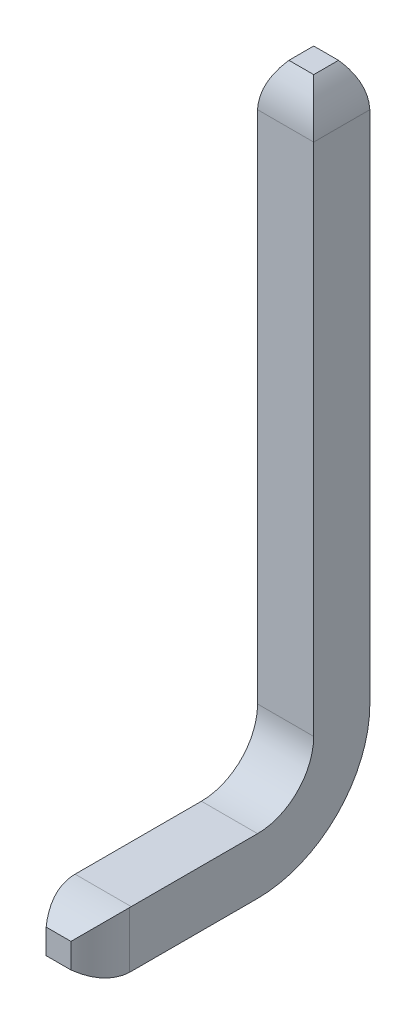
ISO-10303-21;
HEADER;
FILE_DESCRIPTION(('STEP AP214'),'2;1');
FILE_NAME('part.step','',(''),(''),'','','');
FILE_SCHEMA(('AUTOMOTIVE_DESIGN { 1 0 10303 214 1 1 1 1 }'));
ENDSEC;
DATA;
#1=APPLICATION_CONTEXT('core data for automotive mechanical design processes');
#2=APPLICATION_PROTOCOL_DEFINITION('international standard','automotive_design',2000,#1);
#3=PRODUCT_CONTEXT('',#1,'mechanical');
#4=PRODUCT('Part','Part','',(#3));
#5=PRODUCT_RELATED_PRODUCT_CATEGORY('part','',(#4));
#6=PRODUCT_DEFINITION_FORMATION('','',#4);
#7=PRODUCT_DEFINITION_CONTEXT('part definition',#1,'design');
#8=PRODUCT_DEFINITION('design','',#6,#7);
#9=PRODUCT_DEFINITION_SHAPE('','',#8);
#10=(LENGTH_UNIT() NAMED_UNIT(*) SI_UNIT(.MILLI.,.METRE.));
#11=(NAMED_UNIT(*) PLANE_ANGLE_UNIT() SI_UNIT($,.RADIAN.));
#12=(NAMED_UNIT(*) SI_UNIT($,.STERADIAN.) SOLID_ANGLE_UNIT());
#13=UNCERTAINTY_MEASURE_WITH_UNIT(LENGTH_MEASURE(1.E-05),#10,'distance_accuracy_value','');
#14=(GEOMETRIC_REPRESENTATION_CONTEXT(3) GLOBAL_UNCERTAINTY_ASSIGNED_CONTEXT((#13)) GLOBAL_UNIT_ASSIGNED_CONTEXT((#10,
#11,#12)) REPRESENTATION_CONTEXT('',''));
#15=CARTESIAN_POINT('',(0.,0.,0.));
#16=DIRECTION('',(0.,0.,1.));
#17=DIRECTION('',(1.,0.,0.));
#18=AXIS2_PLACEMENT_3D('',#15,#16,#17);
#19=CARTESIAN_POINT('',(0.25019,0.144742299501,2.274099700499));
#20=DIRECTION('',(0.,0.,1.));
#21=DIRECTION('',(0.,-1.,0.));
#22=AXIS2_PLACEMENT_3D('',#19,#20,#21);
#23=PLANE('',#22);
#24=DIRECTION('',(1.,0.,0.));
#25=VECTOR('',#24,1.);
#26=CARTESIAN_POINT('',(-0.25019,0.0050422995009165,2.27409970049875));
#27=LINE('',#26,#25);
#28=CARTESIAN_POINT('',(-0.110489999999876,0.00504229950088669,2.27409970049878));
#29=VERTEX_POINT('',#28);
#30=CARTESIAN_POINT('',(0.110489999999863,0.00504229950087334,2.2740997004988));
#31=VERTEX_POINT('',#30);
#32=EDGE_CURVE('E133',#29,#31,#27,.T.);
#33=ORIENTED_EDGE('',*,*,#32,.F.);
#34=DIRECTION('',(0.,-1.,0.));
#35=VECTOR('',#34,1.);
#36=CARTESIAN_POINT('',(-0.11048999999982,0.144742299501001,2.27409970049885));
#37=LINE('',#36,#35);
#38=CARTESIAN_POINT('',(-0.110489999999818,-0.215937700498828,2.27409970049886));
#39=VERTEX_POINT('',#38);
#40=EDGE_CURVE('E130',#39,#29,#37,.F.);
#41=ORIENTED_EDGE('',*,*,#40,.F.);
#42=DIRECTION('',(1.,0.,0.));
#43=VECTOR('',#42,1.);
#44=CARTESIAN_POINT('',(-0.25019,-0.215937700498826,2.27409970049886));
#45=LINE('',#44,#43);
#46=CARTESIAN_POINT('',(0.110489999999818,-0.215937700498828,2.27409970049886));
#47=VERTEX_POINT('',#46);
#48=EDGE_CURVE('E119',#47,#39,#45,.F.);
#49=ORIENTED_EDGE('',*,*,#48,.F.);
#50=DIRECTION('',(0.,-1.,0.));
#51=VECTOR('',#50,1.);
#52=CARTESIAN_POINT('',(0.110489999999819,0.144742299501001,2.27409970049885));
#53=LINE('',#52,#51);
#54=EDGE_CURVE('E141',#31,#47,#53,.T.);
#55=ORIENTED_EDGE('',*,*,#54,.F.);
#56=EDGE_LOOP('',(#33,#41,#49,#55));
#57=FACE_BOUND('',#56,.T.);
#58=ADVANCED_FACE('F17',(#57),#23,.T.);
#59=CARTESIAN_POINT('',(0.384591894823,0.144742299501,1.87645800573));
#60=DIRECTION('',(0.,-1.,0.));
#61=DIRECTION('',(0.,0.,-1.));
#62=AXIS2_PLACEMENT_3D('',#59,#60,#61);
#63=CYLINDRICAL_SURFACE('',#62,0.635);
#64=CARTESIAN_POINT('',(-0.250190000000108,0.144531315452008,1.893099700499));
#65=CARTESIAN_POINT('',(-0.24981277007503,0.144160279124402,1.90756412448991));
#66=CARTESIAN_POINT('',(-0.248937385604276,0.143291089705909,1.92199284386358));
#67=CARTESIAN_POINT('',(-0.246222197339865,0.140588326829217,1.95065552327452));
#68=CARTESIAN_POINT('',(-0.244383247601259,0.138755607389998,1.96488964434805));
#69=CARTESIAN_POINT('',(-0.237513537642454,0.131904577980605,2.00686603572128));
#70=CARTESIAN_POINT('',(-0.231120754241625,0.125524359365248,2.03418199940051));
#71=CARTESIAN_POINT('',(-0.215201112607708,0.109630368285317,2.0867638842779));
#72=CARTESIAN_POINT('',(-0.205684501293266,0.100126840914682,2.11203617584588));
#73=CARTESIAN_POINT('',(-0.184043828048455,0.0785133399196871,2.16032445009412));
#74=CARTESIAN_POINT('',(-0.171912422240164,0.066396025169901,2.1833338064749));
#75=CARTESIAN_POINT('',(-0.15129887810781,0.045805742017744,2.2174193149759));
#76=CARTESIAN_POINT('',(-0.143507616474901,0.0380231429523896,2.22935261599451));
#77=CARTESIAN_POINT('',(-0.127388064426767,0.0219214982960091,2.25235328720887));
#78=CARTESIAN_POINT('',(-0.119062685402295,0.0136053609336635,2.26342472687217));
#79=CARTESIAN_POINT('',(-0.11048999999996,0.00504229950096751,2.27409970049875));
#80=B_SPLINE_CURVE_WITH_KNOTS('',3,(#64,#65,#66,#67,#68,#69,#70,#71,#72,#73,#74,#75,#76,#77,#78,
#79),.UNSPECIFIED.,.F.,.F.,(4,2,2,2,2,2,2,4),(0.,0.0433870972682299,0.0867358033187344,
0.172547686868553,0.258080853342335,0.343857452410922,0.392536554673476,0.440969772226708),.UNSPECIFIED.);
#81=CARTESIAN_POINT('',(-0.250190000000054,0.144531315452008,1.893099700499));
#82=VERTEX_POINT('',#81);
#83=EDGE_CURVE('E152',#82,#29,#80,.T.);
#84=ORIENTED_EDGE('',*,*,#83,.F.);
#85=DIRECTION('',(0.,1.,0.));
#86=VECTOR('',#85,1.);
#87=CARTESIAN_POINT('',(-0.250189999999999,0.144742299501,1.893099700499));
#88=LINE('',#87,#86);
#89=CARTESIAN_POINT('',(-0.250190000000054,-0.355426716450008,1.893099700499));
#90=VERTEX_POINT('',#89);
#91=EDGE_CURVE('E140',#82,#90,#88,.F.);
#92=ORIENTED_EDGE('',*,*,#91,.T.);
#93=CARTESIAN_POINT('',(-0.110489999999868,-0.215937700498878,2.2740997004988));
#94=CARTESIAN_POINT('',(-0.127635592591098,-0.233064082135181,2.25276889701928));
#95=CARTESIAN_POINT('',(-0.143837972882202,-0.249248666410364,2.22975119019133));
#96=CARTESIAN_POINT('',(-0.173789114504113,-0.279165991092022,2.18023573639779));
#97=CARTESIAN_POINT('',(-0.187504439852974,-0.292865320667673,2.15369784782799));
#98=CARTESIAN_POINT('',(-0.211535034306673,-0.316864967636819,2.09736919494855));
#99=CARTESIAN_POINT('',(-0.221823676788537,-0.327138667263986,2.06755524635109));
#100=CARTESIAN_POINT('',(-0.237911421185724,-0.34319724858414,2.0057644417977));
#101=CARTESIAN_POINT('',(-0.243743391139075,-0.349014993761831,1.97380534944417));
#102=CARTESIAN_POINT('',(-0.247902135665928,-0.353156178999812,1.93339767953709));
#103=CARTESIAN_POINT('',(-0.248573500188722,-0.353824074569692,1.9253676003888));
#104=CARTESIAN_POINT('',(-0.249611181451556,-0.354854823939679,1.9092622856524));
#105=CARTESIAN_POINT('',(-0.24997727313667,-0.355217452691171,1.90118702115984));
#106=CARTESIAN_POINT('',(-0.250190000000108,-0.355426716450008,1.893099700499));
#107=B_SPLINE_CURVE_WITH_KNOTS('',3,(#93,#94,#95,#96,#97,#98,#99,#100,#101,#102,#103,#104,#105,
#106),.UNSPECIFIED.,.F.,.F.,(4,2,2,2,2,2,4),(0.,0.0969606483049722,0.195141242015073,
0.294067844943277,0.392257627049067,0.416507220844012,0.440774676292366),.UNSPECIFIED.);
#108=EDGE_CURVE('E20',#39,#90,#107,.T.);
#109=ORIENTED_EDGE('',*,*,#108,.F.);
#110=ORIENTED_EDGE('',*,*,#40,.T.);
#111=EDGE_LOOP('',(#84,#92,#109,#110));
#112=FACE_BOUND('',#111,.T.);
#113=ADVANCED_FACE('F138',(#112),#63,.T.);
#114=CARTESIAN_POINT('',(-0.25019,0.279362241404,1.876729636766));
#115=DIRECTION('',(1.,0.,0.));
#116=DIRECTION('',(0.,0.,-1.));
#117=AXIS2_PLACEMENT_3D('',#114,#115,#116);
#118=CYLINDRICAL_SURFACE('',#117,0.635);
#119=CARTESIAN_POINT('',(-0.25019,0.279362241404,1.876729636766));
#120=DIRECTION('',(1.,0.,0.));
#121=DIRECTION('',(0.,0.,-1.));
#122=AXIS2_PLACEMENT_3D('',#119,#120,#121);
#123=CIRCLE('',#122,0.635);
#124=CARTESIAN_POINT('',(-0.25019,-0.355637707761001,1.876729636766));
#125=VERTEX_POINT('',#124);
#126=EDGE_CURVE('E235',#90,#125,#123,.T.);
#127=ORIENTED_EDGE('',*,*,#126,.T.);
#128=DIRECTION('',(1.,0.,0.));
#129=VECTOR('',#128,1.);
#130=CARTESIAN_POINT('',(-0.25019,-0.355637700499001,1.876729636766));
#131=LINE('',#130,#129);
#132=CARTESIAN_POINT('',(0.250190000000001,-0.355637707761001,1.876729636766));
#133=VERTEX_POINT('',#132);
#134=EDGE_CURVE('E145',#133,#125,#131,.F.);
#135=ORIENTED_EDGE('',*,*,#134,.F.);
#136=CARTESIAN_POINT('',(0.250190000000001,0.279362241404,1.876729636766));
#137=DIRECTION('',(1.,0.,0.));
#138=DIRECTION('',(0.,0.,-1.));
#139=AXIS2_PLACEMENT_3D('',#136,#137,#138);
#140=CIRCLE('',#139,0.635);
#141=CARTESIAN_POINT('',(0.250190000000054,-0.355426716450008,1.893099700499));
#142=VERTEX_POINT('',#141);
#143=EDGE_CURVE('E238',#142,#133,#140,.T.);
#144=ORIENTED_EDGE('',*,*,#143,.F.);
#145=CARTESIAN_POINT('',(0.110489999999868,-0.215937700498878,2.2740997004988));
#146=CARTESIAN_POINT('',(0.127635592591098,-0.233064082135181,2.25276889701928));
#147=CARTESIAN_POINT('',(0.143837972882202,-0.249248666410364,2.22975119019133));
#148=CARTESIAN_POINT('',(0.173789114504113,-0.279165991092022,2.18023573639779));
#149=CARTESIAN_POINT('',(0.187504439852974,-0.292865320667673,2.15369784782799));
#150=CARTESIAN_POINT('',(0.211535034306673,-0.316864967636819,2.09736919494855));
#151=CARTESIAN_POINT('',(0.221823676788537,-0.327138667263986,2.06755524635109));
#152=CARTESIAN_POINT('',(0.237911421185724,-0.34319724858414,2.0057644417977));
#153=CARTESIAN_POINT('',(0.243743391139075,-0.349014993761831,1.97380534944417));
#154=CARTESIAN_POINT('',(0.247902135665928,-0.353156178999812,1.93339767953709));
#155=CARTESIAN_POINT('',(0.248573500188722,-0.353824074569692,1.9253676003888));
#156=CARTESIAN_POINT('',(0.249611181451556,-0.354854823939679,1.9092622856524));
#157=CARTESIAN_POINT('',(0.24997727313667,-0.355217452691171,1.90118702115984));
#158=CARTESIAN_POINT('',(0.250190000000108,-0.355426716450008,1.893099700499));
#159=B_SPLINE_CURVE_WITH_KNOTS('',3,(#145,#146,#147,#148,#149,#150,#151,#152,#153,#154,#155,
#156,#157,#158),.UNSPECIFIED.,.F.,.F.,(4,2,2,2,2,2,4),(0.,0.0969606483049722,0.195141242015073,
0.294067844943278,0.392257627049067,0.416507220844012,0.440774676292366),.UNSPECIFIED.);
#160=EDGE_CURVE('E126',#47,#142,#159,.T.);
#161=ORIENTED_EDGE('',*,*,#160,.F.);
#162=ORIENTED_EDGE('',*,*,#48,.T.);
#163=ORIENTED_EDGE('',*,*,#108,.T.);
#164=EDGE_LOOP('',(#127,#135,#144,#161,#162,#163));
#165=FACE_BOUND('',#164,.T.);
#166=ADVANCED_FACE('F122',(#165),#118,.T.);
#167=CARTESIAN_POINT('',(-0.384591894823,0.144742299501,1.87645800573));
#168=DIRECTION('',(0.,-1.,0.));
#169=DIRECTION('',(0.,0.,-1.));
#170=AXIS2_PLACEMENT_3D('',#167,#168,#169);
#171=CYLINDRICAL_SURFACE('',#170,0.635);
#172=CARTESIAN_POINT('',(0.110489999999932,0.00504229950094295,2.27409970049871));
#173=CARTESIAN_POINT('',(0.127635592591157,0.0221686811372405,2.25276889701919));
#174=CARTESIAN_POINT('',(0.143837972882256,0.038353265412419,2.22975119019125));
#175=CARTESIAN_POINT('',(0.173789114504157,0.0682705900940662,2.18023573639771));
#176=CARTESIAN_POINT('',(0.187504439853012,0.0819699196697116,2.15369784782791));
#177=CARTESIAN_POINT('',(0.211535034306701,0.105969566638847,2.09736919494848));
#178=CARTESIAN_POINT('',(0.22182367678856,0.116243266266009,2.06755524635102));
#179=CARTESIAN_POINT('',(0.237911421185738,0.132301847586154,2.00576444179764));
#180=CARTESIAN_POINT('',(0.243743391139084,0.138119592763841,1.97380534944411));
#181=CARTESIAN_POINT('',(0.247902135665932,0.142260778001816,1.93339767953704));
#182=CARTESIAN_POINT('',(0.248573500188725,0.142928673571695,1.92536760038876));
#183=CARTESIAN_POINT('',(0.249611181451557,0.14395942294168,1.90926228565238));
#184=CARTESIAN_POINT('',(0.24997727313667,0.144322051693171,1.90118702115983));
#185=CARTESIAN_POINT('',(0.250190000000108,0.144531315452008,1.893099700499));
#186=B_SPLINE_CURVE_WITH_KNOTS('',3,(#172,#173,#174,#175,#176,#177,#178,#179,#180,#181,#182,
#183,#184,#185),.UNSPECIFIED.,.F.,.F.,(4,2,2,2,2,2,4),(0.,0.0969606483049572,0.195141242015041,
0.29406784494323,0.392257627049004,0.41650722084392,0.440774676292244),.UNSPECIFIED.);
#187=CARTESIAN_POINT('',(0.250190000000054,0.144531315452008,1.893099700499));
#188=VERTEX_POINT('',#187);
#189=EDGE_CURVE('E227',#31,#188,#186,.T.);
#190=ORIENTED_EDGE('',*,*,#189,.F.);
#191=ORIENTED_EDGE('',*,*,#54,.T.);
#192=ORIENTED_EDGE('',*,*,#160,.T.);
#193=DIRECTION('',(0.,1.,0.));
#194=VECTOR('',#193,1.);
#195=CARTESIAN_POINT('',(0.250190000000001,0.144742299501,1.893099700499));
#196=LINE('',#195,#194);
#197=EDGE_CURVE('E244',#188,#142,#196,.F.);
#198=ORIENTED_EDGE('',*,*,#197,.F.);
#199=EDGE_LOOP('',(#190,#191,#192,#198));
#200=FACE_BOUND('',#199,.T.);
#201=ADVANCED_FACE('F158',(#200),#171,.T.);
#202=CARTESIAN_POINT('',(-0.25019,-0.355637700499,2.274099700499));
#203=DIRECTION('',(0.,-1.,0.));
#204=DIRECTION('',(0.,0.,-1.));
#205=AXIS2_PLACEMENT_3D('',#202,#203,#204);
#206=PLANE('',#205);
#207=DIRECTION('',(0.,0.,-1.));
#208=VECTOR('',#207,1.);
#209=CARTESIAN_POINT('',(-0.25019,-0.355637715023,-5.396700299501));
#210=LINE('',#209,#208);
#211=CARTESIAN_POINT('',(-0.25019,-0.355637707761,0.75057));
#212=VERTEX_POINT('',#211);
#213=EDGE_CURVE('E237',#125,#212,#210,.T.);
#214=ORIENTED_EDGE('',*,*,#213,.T.);
#215=DIRECTION('',(1.,0.,0.));
#216=VECTOR('',#215,1.);
#217=CARTESIAN_POINT('',(-7.953561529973,-0.355637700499,0.75057));
#218=LINE('',#217,#216);
#219=CARTESIAN_POINT('',(0.250190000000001,-0.355637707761,0.75057));
#220=VERTEX_POINT('',#219);
#221=EDGE_CURVE('E284',#220,#212,#218,.F.);
#222=ORIENTED_EDGE('',*,*,#221,.F.);
#223=DIRECTION('',(0.,0.,-1.));
#224=VECTOR('',#223,1.);
#225=CARTESIAN_POINT('',(0.25019,-0.355637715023,-5.396700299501));
#226=LINE('',#225,#224);
#227=EDGE_CURVE('E240',#133,#220,#226,.T.);
#228=ORIENTED_EDGE('',*,*,#227,.F.);
#229=ORIENTED_EDGE('',*,*,#134,.T.);
#230=EDGE_LOOP('',(#214,#222,#228,#229));
#231=FACE_BOUND('',#230,.T.);
#232=ADVANCED_FACE('F224',(#231),#206,.T.);
#233=CARTESIAN_POINT('',(-0.25019,-0.490257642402,1.876729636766));
#234=DIRECTION('',(1.,0.,0.));
#235=DIRECTION('',(0.,0.,-1.));
#236=AXIS2_PLACEMENT_3D('',#233,#234,#235);
#237=CYLINDRICAL_SURFACE('',#236,0.635);
#238=ORIENTED_EDGE('',*,*,#189,.T.);
#239=CARTESIAN_POINT('',(0.250190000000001,-0.490257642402,1.876729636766));
#240=DIRECTION('',(1.,0.,0.));
#241=DIRECTION('',(0.,0.,-1.));
#242=AXIS2_PLACEMENT_3D('',#239,#240,#241);
#243=CIRCLE('',#242,0.635);
#244=CARTESIAN_POINT('',(0.25019,0.144742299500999,1.876729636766));
#245=VERTEX_POINT('',#244);
#246=EDGE_CURVE('E241',#245,#188,#243,.T.);
#247=ORIENTED_EDGE('',*,*,#246,.F.);
#248=DIRECTION('',(1.,0.,0.));
#249=VECTOR('',#248,1.);
#250=CARTESIAN_POINT('',(-0.25019,0.144742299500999,1.876729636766));
#251=LINE('',#250,#249);
#252=CARTESIAN_POINT('',(-0.25019,0.144742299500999,1.876729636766));
#253=VERTEX_POINT('',#252);
#254=EDGE_CURVE('E277',#245,#253,#251,.F.);
#255=ORIENTED_EDGE('',*,*,#254,.T.);
#256=CARTESIAN_POINT('',(-0.25019,-0.490257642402,1.876729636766));
#257=DIRECTION('',(1.,0.,0.));
#258=DIRECTION('',(0.,0.,-1.));
#259=AXIS2_PLACEMENT_3D('',#256,#257,#258);
#260=CIRCLE('',#259,0.635);
#261=EDGE_CURVE('E232',#253,#82,#260,.T.);
#262=ORIENTED_EDGE('',*,*,#261,.T.);
#263=ORIENTED_EDGE('',*,*,#83,.T.);
#264=ORIENTED_EDGE('',*,*,#32,.T.);
#265=EDGE_LOOP('',(#238,#247,#255,#262,#263,#264));
#266=FACE_BOUND('',#265,.T.);
#267=ADVANCED_FACE('F220',(#266),#237,.T.);
#268=CARTESIAN_POINT('',(-7.953561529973,0.645122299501,0.75057));
#269=DIRECTION('',(1.,0.,0.));
#270=DIRECTION('',(0.,0.,-1.));
#271=AXIS2_PLACEMENT_3D('',#268,#269,#270);
#272=CYLINDRICAL_SURFACE('',#271,1.00076);
#273=ORIENTED_EDGE('',*,*,#221,.T.);
#274=CARTESIAN_POINT('',(-0.25019,0.645122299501,0.75057));
#275=DIRECTION('',(1.,0.,0.));
#276=DIRECTION('',(0.,0.,-1.));
#277=AXIS2_PLACEMENT_3D('',#274,#275,#276);
#278=CIRCLE('',#277,1.00076);
#279=CARTESIAN_POINT('',(-0.25019,0.645122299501,-0.25019));
#280=VERTEX_POINT('',#279);
#281=EDGE_CURVE('E245',#212,#280,#278,.T.);
#282=ORIENTED_EDGE('',*,*,#281,.T.);
#283=DIRECTION('',(1.,0.,0.));
#284=VECTOR('',#283,1.);
#285=CARTESIAN_POINT('',(-7.953561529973,0.645122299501,-0.25019));
#286=LINE('',#285,#284);
#287=CARTESIAN_POINT('',(0.250190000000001,0.645122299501,-0.25019));
#288=VERTEX_POINT('',#287);
#289=EDGE_CURVE('E274',#280,#288,#286,.T.);
#290=ORIENTED_EDGE('',*,*,#289,.T.);
#291=CARTESIAN_POINT('',(0.250190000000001,0.645122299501,0.75057));
#292=DIRECTION('',(1.,0.,0.));
#293=DIRECTION('',(0.,0.,-1.));
#294=AXIS2_PLACEMENT_3D('',#291,#292,#293);
#295=CIRCLE('',#294,1.00076);
#296=EDGE_CURVE('E248',#220,#288,#295,.T.);
#297=ORIENTED_EDGE('',*,*,#296,.F.);
#298=EDGE_LOOP('',(#273,#282,#290,#297));
#299=FACE_BOUND('',#298,.T.);
#300=ADVANCED_FACE('F217',(#299),#272,.T.);
#301=CARTESIAN_POINT('',(-0.25019,0.144742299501,2.274099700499));
#302=DIRECTION('',(0.,-1.,0.));
#303=DIRECTION('',(0.,0.,-1.));
#304=AXIS2_PLACEMENT_3D('',#301,#302,#303);
#305=PLANE('',#304);
#306=ORIENTED_EDGE('',*,*,#254,.F.);
#307=DIRECTION('',(0.,0.,-1.));
#308=VECTOR('',#307,1.);
#309=CARTESIAN_POINT('',(0.25019,0.144742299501,2.274099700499));
#310=LINE('',#309,#308);
#311=CARTESIAN_POINT('',(0.250190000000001,0.144742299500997,0.750570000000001));
#312=VERTEX_POINT('',#311);
#313=EDGE_CURVE('E280',#312,#245,#310,.F.);
#314=ORIENTED_EDGE('',*,*,#313,.F.);
#315=DIRECTION('',(1.,0.,0.));
#316=VECTOR('',#315,1.);
#317=CARTESIAN_POINT('',(-7.953561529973,0.144742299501,0.75057));
#318=LINE('',#317,#316);
#319=CARTESIAN_POINT('',(-0.25019,0.144742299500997,0.750570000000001));
#320=VERTEX_POINT('',#319);
#321=EDGE_CURVE('E259',#312,#320,#318,.F.);
#322=ORIENTED_EDGE('',*,*,#321,.T.);
#323=DIRECTION('',(0.,0.,-1.));
#324=VECTOR('',#323,1.);
#325=CARTESIAN_POINT('',(-0.25019,0.144742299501,2.274099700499));
#326=LINE('',#325,#324);
#327=EDGE_CURVE('E249',#253,#320,#326,.T.);
#328=ORIENTED_EDGE('',*,*,#327,.F.);
#329=EDGE_LOOP('',(#306,#314,#322,#328));
#330=FACE_BOUND('',#329,.T.);
#331=ADVANCED_FACE('F213',(#330),#305,.F.);
#332=CARTESIAN_POINT('',(-0.384591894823,5.215758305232,-0.25019));
#333=DIRECTION('',(0.,0.,1.));
#334=DIRECTION('',(1.,0.,0.));
#335=AXIS2_PLACEMENT_3D('',#332,#333,#334);
#336=CYLINDRICAL_SURFACE('',#335,0.635);
#337=DIRECTION('',(0.,0.,1.));
#338=VECTOR('',#337,1.);
#339=CARTESIAN_POINT('',(0.11049,5.6134,0.25019));
#340=LINE('',#339,#338);
#341=CARTESIAN_POINT('',(0.110490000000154,5.61340000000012,0.110490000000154));
#342=VERTEX_POINT('',#341);
#343=CARTESIAN_POINT('',(0.110490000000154,5.61340000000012,-0.110490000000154));
#344=VERTEX_POINT('',#343);
#345=EDGE_CURVE('E252',#342,#344,#340,.F.);
#346=ORIENTED_EDGE('',*,*,#345,.F.);
#347=CARTESIAN_POINT('',(-0.384591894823,5.215758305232,-0.384591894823));
#348=DIRECTION('',(0.707106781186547,0.,-0.707106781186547));
#349=DIRECTION('',(0.707106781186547,0.,0.707106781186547));
#350=AXIS2_PLACEMENT_3D('',#347,#348,#349);
#351=ELLIPSE('',#350,0.898025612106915,0.635);
#352=CARTESIAN_POINT('',(0.25019,5.23240000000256,0.25019));
#353=VERTEX_POINT('',#352);
#354=EDGE_CURVE('E262',#353,#342,#351,.F.);
#355=ORIENTED_EDGE('',*,*,#354,.F.);
#356=DIRECTION('',(0.,0.,1.));
#357=VECTOR('',#356,1.);
#358=CARTESIAN_POINT('',(0.25019,5.2324,0.25019));
#359=LINE('',#358,#357);
#360=CARTESIAN_POINT('',(0.25019,5.23240000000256,-0.25019));
#361=VERTEX_POINT('',#360);
#362=EDGE_CURVE('E301',#361,#353,#359,.T.);
#363=ORIENTED_EDGE('',*,*,#362,.F.);
#364=CARTESIAN_POINT('',(-0.384591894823,5.215758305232,0.384591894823));
#365=DIRECTION('',(0.707106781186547,0.,0.707106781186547));
#366=DIRECTION('',(0.707106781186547,0.,-0.707106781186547));
#367=AXIS2_PLACEMENT_3D('',#364,#365,#366);
#368=ELLIPSE('',#367,0.898025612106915,0.635);
#369=EDGE_CURVE('E253',#344,#361,#368,.F.);
#370=ORIENTED_EDGE('',*,*,#369,.F.);
#371=EDGE_LOOP('',(#346,#355,#363,#370));
#372=FACE_BOUND('',#371,.T.);
#373=ADVANCED_FACE('F209',(#372),#336,.T.);
#374=CARTESIAN_POINT('',(-0.25019,5.6134,0.25019));
#375=DIRECTION('',(0.,1.,0.));
#376=DIRECTION('',(0.,0.,1.));
#377=AXIS2_PLACEMENT_3D('',#374,#375,#376);
#378=PLANE('',#377);
#379=DIRECTION('',(1.,0.,0.));
#380=VECTOR('',#379,1.);
#381=CARTESIAN_POINT('',(-0.25019,5.61340000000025,0.110490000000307));
#382=LINE('',#381,#380);
#383=CARTESIAN_POINT('',(-0.110490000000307,5.61340000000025,0.110490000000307));
#384=VERTEX_POINT('',#383);
#385=EDGE_CURVE('E264',#342,#384,#382,.F.);
#386=ORIENTED_EDGE('',*,*,#385,.F.);
#387=ORIENTED_EDGE('',*,*,#345,.T.);
#388=DIRECTION('',(1.,0.,0.));
#389=VECTOR('',#388,1.);
#390=CARTESIAN_POINT('',(-0.25019,5.61340000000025,-0.110490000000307));
#391=LINE('',#390,#389);
#392=CARTESIAN_POINT('',(-0.110490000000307,5.61340000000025,-0.110490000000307));
#393=VERTEX_POINT('',#392);
#394=EDGE_CURVE('E256',#393,#344,#391,.T.);
#395=ORIENTED_EDGE('',*,*,#394,.F.);
#396=DIRECTION('',(0.,0.,1.));
#397=VECTOR('',#396,1.);
#398=CARTESIAN_POINT('',(-0.110490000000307,5.61340000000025,-0.25019));
#399=LINE('',#398,#397);
#400=EDGE_CURVE('E268',#384,#393,#399,.F.);
#401=ORIENTED_EDGE('',*,*,#400,.F.);
#402=EDGE_LOOP('',(#386,#387,#395,#401));
#403=FACE_BOUND('',#402,.T.);
#404=ADVANCED_FACE('F205',(#403),#378,.T.);
#405=CARTESIAN_POINT('',(-0.25019,5.215758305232,0.384591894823));
#406=DIRECTION('',(1.,0.,0.));
#407=DIRECTION('',(0.,0.,-1.));
#408=AXIS2_PLACEMENT_3D('',#405,#406,#407);
#409=CYLINDRICAL_SURFACE('',#408,0.635);
#410=DIRECTION('',(-1.,0.,0.));
#411=VECTOR('',#410,1.);
#412=CARTESIAN_POINT('',(-0.25019,5.2324,-0.25019));
#413=LINE('',#412,#411);
#414=CARTESIAN_POINT('',(-0.25019,5.23240000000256,-0.25019));
#415=VERTEX_POINT('',#414);
#416=EDGE_CURVE('E298',#415,#361,#413,.F.);
#417=ORIENTED_EDGE('',*,*,#416,.F.);
#418=CARTESIAN_POINT('',(0.384591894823,5.215758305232,0.384591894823));
#419=DIRECTION('',(-0.707106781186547,0.,0.707106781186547));
#420=DIRECTION('',(0.707106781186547,0.,0.707106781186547));
#421=AXIS2_PLACEMENT_3D('',#418,#419,#420);
#422=ELLIPSE('',#421,0.898025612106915,0.635);
#423=EDGE_CURVE('E265',#393,#415,#422,.T.);
#424=ORIENTED_EDGE('',*,*,#423,.F.);
#425=ORIENTED_EDGE('',*,*,#394,.T.);
#426=ORIENTED_EDGE('',*,*,#369,.T.);
#427=EDGE_LOOP('',(#417,#424,#425,#426));
#428=FACE_BOUND('',#427,.T.);
#429=ADVANCED_FACE('F201',(#428),#409,.T.);
#430=CARTESIAN_POINT('',(-7.953561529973,0.645122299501,0.75057));
#431=DIRECTION('',(1.,0.,0.));
#432=DIRECTION('',(0.,0.,-1.));
#433=AXIS2_PLACEMENT_3D('',#430,#431,#432);
#434=CYLINDRICAL_SURFACE('',#433,0.50038);
#435=ORIENTED_EDGE('',*,*,#321,.F.);
#436=CARTESIAN_POINT('',(0.250190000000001,0.645122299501,0.75057));
#437=DIRECTION('',(1.,0.,0.));
#438=DIRECTION('',(0.,0.,-1.));
#439=AXIS2_PLACEMENT_3D('',#436,#437,#438);
#440=CIRCLE('',#439,0.50038);
#441=CARTESIAN_POINT('',(0.25019,0.645122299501,0.25019));
#442=VERTEX_POINT('',#441);
#443=EDGE_CURVE('E255',#442,#312,#440,.F.);
#444=ORIENTED_EDGE('',*,*,#443,.F.);
#445=DIRECTION('',(-1.,0.,0.));
#446=VECTOR('',#445,1.);
#447=CARTESIAN_POINT('',(-0.25019,0.645122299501,0.25019));
#448=LINE('',#447,#446);
#449=CARTESIAN_POINT('',(-0.25019,0.645122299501,0.25019));
#450=VERTEX_POINT('',#449);
#451=EDGE_CURVE('E270',#442,#450,#448,.T.);
#452=ORIENTED_EDGE('',*,*,#451,.T.);
#453=CARTESIAN_POINT('',(-0.25019,0.645122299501,0.75057));
#454=DIRECTION('',(1.,0.,0.));
#455=DIRECTION('',(0.,0.,-1.));
#456=AXIS2_PLACEMENT_3D('',#453,#454,#455);
#457=CIRCLE('',#456,0.50038);
#458=EDGE_CURVE('E260',#320,#450,#457,.T.);
#459=ORIENTED_EDGE('',*,*,#458,.F.);
#460=EDGE_LOOP('',(#435,#444,#452,#459));
#461=FACE_BOUND('',#460,.T.);
#462=ADVANCED_FACE('F197',(#461),#434,.F.);
#463=CARTESIAN_POINT('',(-0.25019,5.215758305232,-0.384591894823));
#464=DIRECTION('',(1.,0.,0.));
#465=DIRECTION('',(0.,0.,-1.));
#466=AXIS2_PLACEMENT_3D('',#463,#464,#465);
#467=CYLINDRICAL_SURFACE('',#466,0.635);
#468=ORIENTED_EDGE('',*,*,#385,.T.);
#469=CARTESIAN_POINT('',(0.384591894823,5.215758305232,-0.384591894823));
#470=DIRECTION('',(0.707106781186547,0.,0.707106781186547));
#471=DIRECTION('',(-0.707106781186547,0.,0.707106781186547));
#472=AXIS2_PLACEMENT_3D('',#469,#470,#471);
#473=ELLIPSE('',#472,0.898025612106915,0.635);
#474=CARTESIAN_POINT('',(-0.25019,5.23240000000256,0.25019));
#475=VERTEX_POINT('',#474);
#476=EDGE_CURVE('E267',#475,#384,#473,.F.);
#477=ORIENTED_EDGE('',*,*,#476,.F.);
#478=DIRECTION('',(-1.,0.,0.));
#479=VECTOR('',#478,1.);
#480=CARTESIAN_POINT('',(-0.25019,5.2324,0.25019));
#481=LINE('',#480,#479);
#482=EDGE_CURVE('E38',#475,#353,#481,.F.);
#483=ORIENTED_EDGE('',*,*,#482,.T.);
#484=ORIENTED_EDGE('',*,*,#354,.T.);
#485=EDGE_LOOP('',(#468,#477,#483,#484));
#486=FACE_BOUND('',#485,.T.);
#487=ADVANCED_FACE('F193',(#486),#467,.T.);
#488=CARTESIAN_POINT('',(0.25019,5.6134,0.25019));
#489=DIRECTION('',(1.,0.,0.));
#490=DIRECTION('',(0.,1.,0.));
#491=AXIS2_PLACEMENT_3D('',#488,#489,#490);
#492=PLANE('',#491);
#493=DIRECTION('',(0.,1.,0.));
#494=VECTOR('',#493,1.);
#495=CARTESIAN_POINT('',(0.25019,-2.0574,0.25019));
#496=LINE('',#495,#494);
#497=EDGE_CURVE('E303',#353,#442,#496,.F.);
#498=ORIENTED_EDGE('',*,*,#497,.T.);
#499=ORIENTED_EDGE('',*,*,#443,.T.);
#500=ORIENTED_EDGE('',*,*,#313,.T.);
#501=ORIENTED_EDGE('',*,*,#246,.T.);
#502=ORIENTED_EDGE('',*,*,#197,.T.);
#503=ORIENTED_EDGE('',*,*,#143,.T.);
#504=ORIENTED_EDGE('',*,*,#227,.T.);
#505=ORIENTED_EDGE('',*,*,#296,.T.);
#506=DIRECTION('',(0.,1.,0.));
#507=VECTOR('',#506,1.);
#508=CARTESIAN_POINT('',(0.25019,-2.0574,-0.25019));
#509=LINE('',#508,#507);
#510=EDGE_CURVE('E295',#361,#288,#509,.F.);
#511=ORIENTED_EDGE('',*,*,#510,.F.);
#512=ORIENTED_EDGE('',*,*,#362,.T.);
#513=EDGE_LOOP('',(#498,#499,#500,#501,#502,#503,#504,#505,#511,#512));
#514=FACE_BOUND('',#513,.T.);
#515=ADVANCED_FACE('F189',(#514),#492,.T.);
#516=CARTESIAN_POINT('',(-0.25019,-2.0574,-0.25019));
#517=DIRECTION('',(0.,0.,-1.));
#518=DIRECTION('',(-1.,0.,0.));
#519=AXIS2_PLACEMENT_3D('',#516,#517,#518);
#520=PLANE('',#519);
#521=ORIENTED_EDGE('',*,*,#289,.F.);
#522=DIRECTION('',(0.,1.,0.));
#523=VECTOR('',#522,1.);
#524=CARTESIAN_POINT('',(-0.25019,5.6134,-0.25019));
#525=LINE('',#524,#523);
#526=EDGE_CURVE('E306',#280,#415,#525,.T.);
#527=ORIENTED_EDGE('',*,*,#526,.T.);
#528=ORIENTED_EDGE('',*,*,#416,.T.);
#529=ORIENTED_EDGE('',*,*,#510,.T.);
#530=EDGE_LOOP('',(#521,#527,#528,#529));
#531=FACE_BOUND('',#530,.T.);
#532=ADVANCED_FACE('F185',(#531),#520,.T.);
#533=CARTESIAN_POINT('',(0.384591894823,5.215758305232,-0.25019));
#534=DIRECTION('',(0.,0.,1.));
#535=DIRECTION('',(1.,0.,0.));
#536=AXIS2_PLACEMENT_3D('',#533,#534,#535);
#537=CYLINDRICAL_SURFACE('',#536,0.635);
#538=DIRECTION('',(0.,0.,1.));
#539=VECTOR('',#538,1.);
#540=CARTESIAN_POINT('',(-0.25019,5.2324,0.25019));
#541=LINE('',#540,#539);
#542=EDGE_CURVE('E30',#415,#475,#541,.T.);
#543=ORIENTED_EDGE('',*,*,#542,.T.);
#544=ORIENTED_EDGE('',*,*,#476,.T.);
#545=ORIENTED_EDGE('',*,*,#400,.T.);
#546=ORIENTED_EDGE('',*,*,#423,.T.);
#547=EDGE_LOOP('',(#543,#544,#545,#546));
#548=FACE_BOUND('',#547,.T.);
#549=ADVANCED_FACE('F179',(#548),#537,.T.);
#550=CARTESIAN_POINT('',(-0.25019,-2.0574,0.25019));
#551=DIRECTION('',(0.,0.,-1.));
#552=DIRECTION('',(-1.,0.,0.));
#553=AXIS2_PLACEMENT_3D('',#550,#551,#552);
#554=PLANE('',#553);
#555=ORIENTED_EDGE('',*,*,#482,.F.);
#556=DIRECTION('',(0.,1.,0.));
#557=VECTOR('',#556,1.);
#558=CARTESIAN_POINT('',(-0.25019,5.6134,0.25019));
#559=LINE('',#558,#557);
#560=EDGE_CURVE('E11',#475,#450,#559,.F.);
#561=ORIENTED_EDGE('',*,*,#560,.T.);
#562=ORIENTED_EDGE('',*,*,#451,.F.);
#563=ORIENTED_EDGE('',*,*,#497,.F.);
#564=EDGE_LOOP('',(#555,#561,#562,#563));
#565=FACE_BOUND('',#564,.T.);
#566=ADVANCED_FACE('F173',(#565),#554,.F.);
#567=CARTESIAN_POINT('',(-0.25019,5.6134,0.25019));
#568=DIRECTION('',(1.,0.,0.));
#569=DIRECTION('',(0.,1.,0.));
#570=AXIS2_PLACEMENT_3D('',#567,#568,#569);
#571=PLANE('',#570);
#572=ORIENTED_EDGE('',*,*,#542,.F.);
#573=ORIENTED_EDGE('',*,*,#526,.F.);
#574=ORIENTED_EDGE('',*,*,#281,.F.);
#575=ORIENTED_EDGE('',*,*,#213,.F.);
#576=ORIENTED_EDGE('',*,*,#126,.F.);
#577=ORIENTED_EDGE('',*,*,#91,.F.);
#578=ORIENTED_EDGE('',*,*,#261,.F.);
#579=ORIENTED_EDGE('',*,*,#327,.T.);
#580=ORIENTED_EDGE('',*,*,#458,.T.);
#581=ORIENTED_EDGE('',*,*,#560,.F.);
#582=EDGE_LOOP('',(#572,#573,#574,#575,#576,#577,#578,#579,#580,#581));
#583=FACE_BOUND('',#582,.T.);
#584=ADVANCED_FACE('F171',(#583),#571,.F.);
#585=CLOSED_SHELL('',(#58,#113,#166,#201,#232,#267,#300,#331,#373,#404,#429,#462,#487,#515,#532,
#549,#566,#584));
#586=MANIFOLD_SOLID_BREP('B1',#585);
#587=ADVANCED_BREP_SHAPE_REPRESENTATION('',(#18,#586),#14);
#588=SHAPE_DEFINITION_REPRESENTATION(#9,#587);
ENDSEC;
END-ISO-10303-21;
